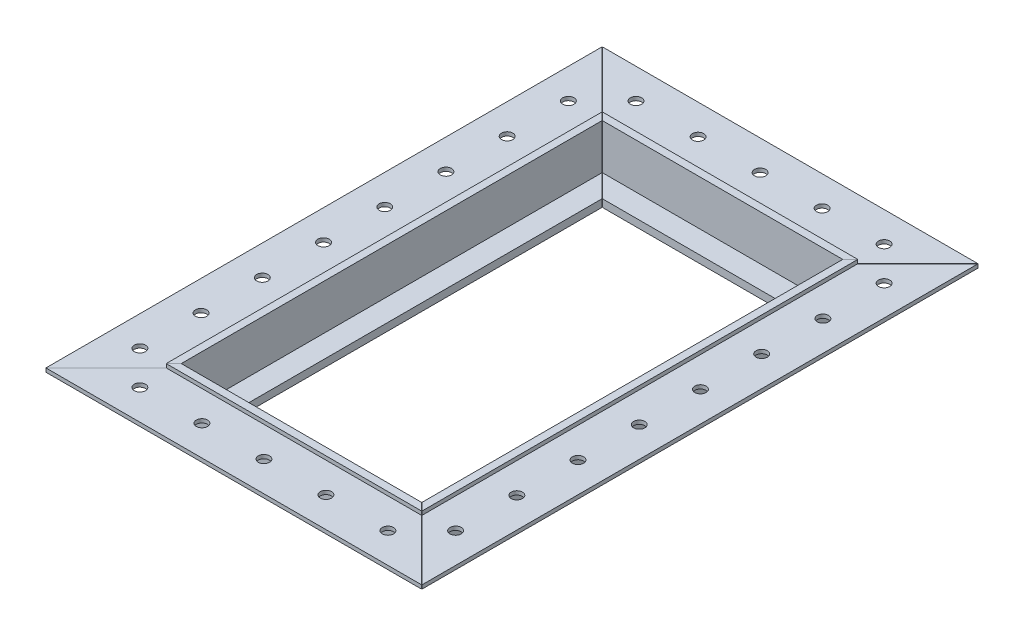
from build123d import *

# Parameters (mm, degrees)
BOSS_EXTRUDE1_DEPTH    = 88.9
BOSS_EXTRUDE1_2_DEPTH  = 88.9
BOSS_EXTRUDE2_DEPTH    = 79.375
SKETCH4_W              = 25.4
SKETCH4_H              = 234.95
CUT_EXTRUDE1_DEPTH     = 158.75
SKETCH5_W              = 25.4
SKETCH5_H              = 19.05
CUT_EXTRUDE2_DEPTH     = 243.820047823
CUT_EXTRUDE3_DEPTH     = 170.855081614
SKETCH7_R              = 2.38125
CUT_EXTRUDE4_DEPTH     = 2.54
LPATTERN1_COUNT        = 8
LPATTERN1_PITCH        = 25.853571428
SKETCH8_R              = 2.3749
CUT_EXTRUDE5_DEPTH     = 2.54
LPATTERN2_COUNT        = 5
LPATTERN2_PITCH        = 26.19375
SKETCH9_R              = 2.3749
SKETCH9_R_2            = 2.38125
CUT_EXTRUDE6_DEPTH     = 2.54
SKETCH11_R             = 3.175
SKETCH11_R_2           = 1.5875
BOSS_EXTRUDE3_DEPTH    = 3.175
BOSS_EXTRUDE3_2_DEPTH  = 3.175
BOSS_EXTRUDE3_3_DEPTH  = 3.175
BOSS_EXTRUDE3_4_DEPTH  = 3.175
BOSS_EXTRUDE3_5_DEPTH  = 3.175
BOSS_EXTRUDE3_6_DEPTH  = 3.175
BOSS_EXTRUDE3_7_DEPTH  = 3.175
BOSS_EXTRUDE3_8_DEPTH  = 3.175
BOSS_EXTRUDE3_9_DEPTH  = 3.175
BOSS_EXTRUDE3_10_DEPTH = 3.175
SKETCH12_R             = 3.175
CUT_EXTRUDE10_DEPTH    = 5.08
SKETCH13_R             = 1.5875
BOSS_EXTRUDE4_DEPTH    = 3.175


with BuildPart() as part:
    # Sketch1 → Boss-Extrude1 (new, symmetric)
    with BuildSketch(Plane.XY):
        Polygon((82.55, 3.175), (82.55, 0), (95.25, 0), (95.25, 19.05), (120.65, 19.05), (120.65, 20.6375), (95.25, 20.6375), (95.25, 22.225), (92.075, 22.225), (92.075, 3.175), align=None)
    extrude(amount=BOSS_EXTRUDE1_DEPTH, both=True)



with BuildPart() as body_2:
    # Sketch1 → Boss-Extrude1 2 (new, symmetric)
    with BuildSketch(Plane.XY):
        Polygon((0, 0), (-12.7, 0), (-12.7, 19.05), (-38.1, 19.05), (-38.1, 20.6375), (-12.7, 20.6375), (-12.7, 22.225), (-9.525, 22.225), (-9.525, 3.175), (0, 3.175), align=None)
    extrude(amount=BOSS_EXTRUDE1_2_DEPTH, both=True)


with BuildPart() as part_1:
    add(part.part)

    add(body_2.part)  # Boss-Extrude2 merges body 2
    # Sketch3 → Boss-Extrude2 (add, symmetric)
    with BuildSketch(Plane.ZY.offset(-41.275)):
        Polygon((-79.375, 3.175), (-79.375, 0), (-92.075, 0), (-92.075, 19.05), (-117.475, 19.05), (-117.475, 20.6375), (-92.075, 20.6375), (-92.075, 22.225), (-88.9, 22.225), (-88.9, 3.175), align=None)
        Polygon((79.375, 3.175), (79.375, 0), (92.075, 0), (92.075, 19.05), (117.475, 19.05), (117.475, 20.6375), (92.075, 20.6375), (92.075, 22.225), (88.9, 22.225), (88.9, 3.175), align=None)
    extrude(amount=BOSS_EXTRUDE2_DEPTH, both=True)

    # Sketch4 → Cut-Extrude1 (cut)
    with BuildSketch(Plane(origin=(0, 20.6375, 0), x_dir=(1, 0, 0), z_dir=(0, 1, 0))):
        with Locations((107.95, 0)):
            Rectangle(SKETCH4_W, SKETCH4_H)
        with Locations((-25.4, 0)):
            Rectangle(SKETCH4_W, SKETCH4_H)
    extrude(amount=CUT_EXTRUDE1_DEPTH, mode=Mode.SUBTRACT)

    # Sketch5 → Cut-Extrude2 (cut, through all)
    with BuildSketch(Plane.XY.offset(92.075)):
        with Locations((-25.4, 9.525)):
            Rectangle(SKETCH5_W, SKETCH5_H)
        with Locations((107.95, 9.525)):
            Rectangle(SKETCH5_W, SKETCH5_H)
    extrude(amount=-CUT_EXTRUDE2_DEPTH, mode=Mode.SUBTRACT)

    # Sketch6 → Cut-Extrude3 (cut, through all)
    with BuildSketch(Plane(origin=(0, 22.225, 0), x_dir=(1, 0, 0), z_dir=(0, 1, 0))):
        Polygon((120.632039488, 117.492960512), (73.363990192, 70.224911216), (73.757679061, 70.546758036), (120.667960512, 117.457039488), align=None)
        Polygon((-38.082039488, 117.492960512), (-38.117960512, 117.457039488), (8.792320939, 70.546758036), (9.186009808, 70.224911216), align=None)
        Polygon((-38.082039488, -117.492960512), (9.186009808, -70.224911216), (8.792320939, -70.546758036), (-38.117960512, -117.457039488), align=None)
        Polygon((120.632039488, -117.492960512), (120.667960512, -117.457039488), (73.757679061, -70.546758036), (73.363990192, -70.224911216), align=None)
    extrude(amount=-CUT_EXTRUDE3_DEPTH, mode=Mode.SUBTRACT)


with BuildPart() as cut_extrude3_piece_1:
    # of the separate pieces the step leaves, piece 1, a body of its own (cut_extrude3_pieces)
    add(part_1.part.solids().sort_by_distance((-9.525, 3.175, -88.864078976))[0])

    # Sketch7 → Cut-Extrude4 (cut)
    with BuildSketch(Plane(origin=(0, 20.6375, 0), x_dir=(1, 0, 0), z_dir=(0, 1, 0))):
        with Locations(Location((-25.4, 90.4875, 0), (0, 0, 180))):
            Circle(SKETCH7_R)
    cut_extrude4 = extrude(amount=-CUT_EXTRUDE4_DEPTH, mode=Mode.SUBTRACT)

    # LPattern1: Cut-Extrude4 ×8
    with Locations(*[(0, 0, i * LPATTERN1_PITCH) for i in range(1, LPATTERN1_COUNT)]):
        add(cut_extrude4, mode=Mode.SUBTRACT)



with BuildPart() as cut_extrude3_piece_2:
    # of the separate pieces the step leaves, piece 2, a body of its own (cut_extrude3_pieces)
    add(part_1.part.solids().sort_by_distance((92.075, 3.175, 88.864078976))[0])


with BuildPart() as cut_extrude3_piece_3:
    # of the separate pieces the step leaves, piece 3, a body of its own (cut_extrude3_pieces)
    add(part_1.part.solids().sort_by_distance((92.039078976, 3.175, -88.9))[0])

    # Sketch8 → Cut-Extrude5 (cut)
    with BuildSketch(Plane(origin=(0, 20.6375, 0), x_dir=(1, 0, 0), z_dir=(0, 1, 0))):
        with Locations(Location((-11.1125, 104.775, 0), (0, 0, 180))):
            Circle(SKETCH8_R)
    cut_extrude5 = extrude(amount=-CUT_EXTRUDE5_DEPTH, mode=Mode.SUBTRACT)

    # LPattern2: Cut-Extrude5 ×5
    with Locations(*[(i * LPATTERN2_PITCH, 0, 0) for i in range(1, LPATTERN2_COUNT)]):
        add(cut_extrude5, mode=Mode.SUBTRACT)


with BuildPart() as cut_extrude3_piece_4:
    # of the separate pieces the step leaves, piece 4, a body of its own (cut_extrude3_pieces)
    add(part_1.part.solids().sort_by_distance((-9.489078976, 3.175, 88.9))[0])


with BuildPart() as cut_extrude6_tool:
    # Sketch9 → Cut-Extrude6 (new body)
    with BuildSketch(Plane(origin=(0, 20.6375, 0), x_dir=(1, 0, 0), z_dir=(0, 1, 0))):
        with Locations(Location((41.275, 104.775, 0), (0, 0, 180))):
            Circle(SKETCH9_R)
        with Locations(Location((15.08125, 104.775, 0), (0, 0, 180))):
            Circle(SKETCH9_R)
        with Locations(Location((-11.1125, 104.775, 0), (0, 0, 180))):
            Circle(SKETCH9_R)
        with Locations(Location((67.46875, 104.775, 0), (0, 0, 180))):
            Circle(SKETCH9_R)
        with Locations(Location((93.6625, 104.775, 0), (0, 0, 180))):
            Circle(SKETCH9_R)
        with Locations(Location((-25.4, -90.487499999, 0), (0, 0, 180))):
            Circle(SKETCH9_R_2)
        with Locations(Location((-25.4, -64.63392857, 0), (0, 0, 180))):
            Circle(SKETCH9_R_2)
        with Locations(Location((-25.4, -38.780357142, 0), (0, 0, 180))):
            Circle(SKETCH9_R_2)
        with Locations(Location((-25.4, -12.926785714, 0), (0, 0, 180))):
            Circle(SKETCH9_R_2)
        with Locations(Location((-25.4, 12.926785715, 0), (0, 0, 180))):
            Circle(SKETCH9_R_2)
        with Locations(Location((-25.4, 38.780357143, 0), (0, 0, 180))):
            Circle(SKETCH9_R_2)
        with Locations(Location((-25.4, 64.633928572, 0), (0, 0, 180))):
            Circle(SKETCH9_R_2)
        with Locations(Location((-25.4, 90.4875, 0), (0, 0, 180))):
            Circle(SKETCH9_R_2)
        with Locations(Location((93.6625, -104.775, 0), (0, 0, 180))):
            Circle(SKETCH9_R)
        with Locations(Location((67.46875, -104.775, 0), (0, 0, 180))):
            Circle(SKETCH9_R)
        with Locations(Location((-11.1125, -104.775, 0), (0, 0, 180))):
            Circle(SKETCH9_R)
        with Locations(Location((15.08125, -104.775, 0), (0, 0, 180))):
            Circle(SKETCH9_R)
        with Locations(Location((41.275, -104.775, 0), (0, 0, 180))):
            Circle(SKETCH9_R)
        with Locations(Location((107.95, 90.4875, 0), (0, 0, 180))):
            Circle(SKETCH9_R_2)
        with Locations(Location((107.95, 64.633928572, 0), (0, 0, 180))):
            Circle(SKETCH9_R_2)
        with Locations(Location((107.95, 38.780357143, 0), (0, 0, 180))):
            Circle(SKETCH9_R_2)
        with Locations(Location((107.95, 12.926785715, 0), (0, 0, 180))):
            Circle(SKETCH9_R_2)
        with Locations(Location((107.95, -12.926785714, 0), (0, 0, 180))):
            Circle(SKETCH9_R_2)
        with Locations(Location((107.95, -38.780357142, 0), (0, 0, 180))):
            Circle(SKETCH9_R_2)
        with Locations(Location((107.95, -64.63392857, 0), (0, 0, 180))):
            Circle(SKETCH9_R_2)
        with Locations(Location((107.95, -90.487499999, 0), (0, 0, 180))):
            Circle(SKETCH9_R_2)
    extrude(amount=-CUT_EXTRUDE6_DEPTH)


with BuildPart() as cut_extrude3_piece_2_1:
    add(cut_extrude3_piece_2.part)

    # Cut-Extrude6: cut by cut_extrude6_tool
    add(cut_extrude6_tool.part, mode=Mode.SUBTRACT)


with BuildPart() as cut_extrude3_piece_4_1:
    add(cut_extrude3_piece_4.part)

    # Cut-Extrude6: cut by cut_extrude6_tool
    add(cut_extrude6_tool.part, mode=Mode.SUBTRACT)


with BuildPart() as body_5:
    # Sketch11 → Boss-Extrude3 (new body)
    with BuildSketch(Plane(origin=(0, 3.175, 0), x_dir=(1, 0, 0), z_dir=(0, 1, 0))):
        with Locations(Location((3.185521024, -85.725, 0), (0, 0, 180))):
            Circle(SKETCH11_R)
        with Locations(Location((3.185521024, -85.725, 0), (0, 0, 180))):
            Circle(SKETCH11_R_2, mode=Mode.SUBTRACT)
    extrude(amount=BOSS_EXTRUDE3_DEPTH)


with BuildPart() as body_6:
    # Sketch11 → Boss-Extrude3 2 (new body)
    with BuildSketch(Plane(origin=(0, 3.175, 0), x_dir=(1, 0, 0), z_dir=(0, 1, 0))):
        with Locations(Location((-6.35, -76.2, 0), (0, 0, 180))):
            Circle(SKETCH11_R)
        with Locations(Location((-6.35, -76.2, 0), (0, 0, 180))):
            Circle(SKETCH11_R_2, mode=Mode.SUBTRACT)
    extrude(amount=BOSS_EXTRUDE3_2_DEPTH)


with BuildPart() as body_7:
    # Sketch11 → Boss-Extrude3 3 (new body)
    with BuildSketch(Plane(origin=(0, 3.175, 0), x_dir=(1, 0, 0), z_dir=(0, 1, 0))):
        with Locations(Location((-6.35, 0, 0), (0, 0, 180))):
            Circle(SKETCH11_R)
        with Locations(Location((-6.35, 0, 0), (0, 0, 180))):
            Circle(SKETCH11_R_2, mode=Mode.SUBTRACT)
    extrude(amount=BOSS_EXTRUDE3_3_DEPTH)


with BuildPart() as body_8:
    # Sketch11 → Boss-Extrude3 4 (new body)
    with BuildSketch(Plane(origin=(0, 3.175, 0), x_dir=(1, 0, 0), z_dir=(0, 1, 0))):
        with Locations(Location((-6.35, 76.2, 0), (0, 0, 180))):
            Circle(SKETCH11_R)
        with Locations(Location((-6.35, 76.2, 0), (0, 0, 180))):
            Circle(SKETCH11_R_2, mode=Mode.SUBTRACT)
    extrude(amount=BOSS_EXTRUDE3_4_DEPTH)


with BuildPart() as body_9:
    # Sketch11 → Boss-Extrude3 5 (new body)
    with BuildSketch(Plane(origin=(0, 3.175, 0), x_dir=(1, 0, 0), z_dir=(0, 1, 0))):
        with Locations(Location((3.185521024, 85.725, 0), (0, 0, 180))):
            Circle(SKETCH11_R)
        with Locations(Location((3.185521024, 85.725, 0), (0, 0, 180))):
            Circle(SKETCH11_R_2, mode=Mode.SUBTRACT)
    extrude(amount=BOSS_EXTRUDE3_5_DEPTH)


with BuildPart() as body_10:
    # Sketch11 → Boss-Extrude3 6 (new body)
    with BuildSketch(Plane(origin=(0, 3.175, 0), x_dir=(1, 0, 0), z_dir=(0, 1, 0))):
        with Locations(Location((79.364478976, 85.725, 0), (0, 0, 180))):
            Circle(SKETCH11_R)
        with Locations(Location((79.364478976, 85.725, 0), (0, 0, 180))):
            Circle(SKETCH11_R_2, mode=Mode.SUBTRACT)
    extrude(amount=BOSS_EXTRUDE3_6_DEPTH)


with BuildPart() as body_11:
    # Sketch11 → Boss-Extrude3 7 (new body)
    with BuildSketch(Plane(origin=(0, 3.175, 0), x_dir=(1, 0, 0), z_dir=(0, 1, 0))):
        with Locations(Location((88.9, 76.2, 0), (0, 0, 180))):
            Circle(SKETCH11_R)
        with Locations(Location((88.9, 76.2, 0), (0, 0, 180))):
            Circle(SKETCH11_R_2, mode=Mode.SUBTRACT)
    extrude(amount=BOSS_EXTRUDE3_7_DEPTH)


with BuildPart() as body_12:
    # Sketch11 → Boss-Extrude3 8 (new body)
    with BuildSketch(Plane(origin=(0, 3.175, 0), x_dir=(1, 0, 0), z_dir=(0, 1, 0))):
        with Locations(Location((88.9, 0, 0), (0, 0, 180))):
            Circle(SKETCH11_R)
        with Locations(Location((88.9, 0, 0), (0, 0, 180))):
            Circle(SKETCH11_R_2, mode=Mode.SUBTRACT)
    extrude(amount=BOSS_EXTRUDE3_8_DEPTH)


with BuildPart() as body_13:
    # Sketch11 → Boss-Extrude3 9 (new body)
    with BuildSketch(Plane(origin=(0, 3.175, 0), x_dir=(1, 0, 0), z_dir=(0, 1, 0))):
        with Locations(Location((88.9, -76.2, 0), (0, 0, 180))):
            Circle(SKETCH11_R)
        with Locations(Location((88.9, -76.2, 0), (0, 0, 180))):
            Circle(SKETCH11_R_2, mode=Mode.SUBTRACT)
    extrude(amount=BOSS_EXTRUDE3_9_DEPTH)


with BuildPart() as body_14:
    # Sketch11 → Boss-Extrude3 10 (new body)
    with BuildSketch(Plane(origin=(0, 3.175, 0), x_dir=(1, 0, 0), z_dir=(0, 1, 0))):
        with Locations(Location((79.364478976, -85.725, 0), (0, 0, 180))):
            Circle(SKETCH11_R)
        with Locations(Location((79.364478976, -85.725, 0), (0, 0, 180))):
            Circle(SKETCH11_R_2, mode=Mode.SUBTRACT)
    extrude(amount=BOSS_EXTRUDE3_10_DEPTH)


with BuildPart() as cut_extrude10_tool:
    # Sketch12 → Cut-Extrude10 (new body)
    with BuildSketch(Plane(origin=(0, 3.175, 0), x_dir=(1, 0, 0), z_dir=(0, 1, 0))):
        with Locations((-6.35, 76.2)):
            Circle(SKETCH12_R)
        with Locations((3.185521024, 85.725)):
            Circle(SKETCH12_R)
        with Locations((79.364478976, 85.725)):
            Circle(SKETCH12_R)
        with Locations((88.9, 76.2)):
            Circle(SKETCH12_R)
        with Locations((88.9, 0)):
            Circle(SKETCH12_R)
        with Locations((-6.35, 0)):
            Circle(SKETCH12_R)
        with Locations((-6.35, -76.2)):
            Circle(SKETCH12_R)
        with Locations((3.185521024, -85.725)):
            Circle(SKETCH12_R)
        with Locations((79.364478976, -85.725)):
            Circle(SKETCH12_R)
        with Locations((88.9, -76.2)):
            Circle(SKETCH12_R)
    extrude(amount=CUT_EXTRUDE10_DEPTH)


with BuildPart() as body_5_1:
    add(body_5.part)

    # Cut-Extrude10: cut by cut_extrude10_tool
    add(cut_extrude10_tool.part, mode=Mode.SUBTRACT)


with BuildPart() as body_6_1:
    add(body_6.part)

    # Cut-Extrude10: cut by cut_extrude10_tool
    add(cut_extrude10_tool.part, mode=Mode.SUBTRACT)


with BuildPart() as body_7_1:
    add(body_7.part)

    # Cut-Extrude10: cut by cut_extrude10_tool
    add(cut_extrude10_tool.part, mode=Mode.SUBTRACT)


with BuildPart() as body_8_1:
    add(body_8.part)

    # Cut-Extrude10: cut by cut_extrude10_tool
    add(cut_extrude10_tool.part, mode=Mode.SUBTRACT)


with BuildPart() as body_9_1:
    add(body_9.part)

    # Cut-Extrude10: cut by cut_extrude10_tool
    add(cut_extrude10_tool.part, mode=Mode.SUBTRACT)


with BuildPart() as body_10_1:
    add(body_10.part)

    # Cut-Extrude10: cut by cut_extrude10_tool
    add(cut_extrude10_tool.part, mode=Mode.SUBTRACT)


with BuildPart() as body_11_1:
    add(body_11.part)

    # Cut-Extrude10: cut by cut_extrude10_tool
    add(cut_extrude10_tool.part, mode=Mode.SUBTRACT)


with BuildPart() as body_12_1:
    add(body_12.part)

    # Cut-Extrude10: cut by cut_extrude10_tool
    add(cut_extrude10_tool.part, mode=Mode.SUBTRACT)


with BuildPart() as body_13_1:
    add(body_13.part)

    # Cut-Extrude10: cut by cut_extrude10_tool
    add(cut_extrude10_tool.part, mode=Mode.SUBTRACT)


with BuildPart() as body_14_1:
    add(body_14.part)

    # Cut-Extrude10: cut by cut_extrude10_tool
    add(cut_extrude10_tool.part, mode=Mode.SUBTRACT)


with BuildPart() as cut_extrude3_piece_1_1:
    add(cut_extrude3_piece_1.part)

    add(cut_extrude3_piece_2_1.part)  # Boss-Extrude4 merges Cut-Extrude3 piece 2

    add(cut_extrude3_piece_3.part)  # Boss-Extrude4 merges Cut-Extrude3 piece 3

    add(cut_extrude3_piece_4_1.part)  # Boss-Extrude4 merges Cut-Extrude3 piece 4
    # Sketch13 → Boss-Extrude4 (add)
    with BuildSketch(Plane(origin=(0, 3.175, 0), x_dir=(1, 0, 0), z_dir=(0, 1, 0))):
        with Locations((3.185521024, 85.725)):
            Circle(SKETCH13_R)
        with Locations((79.364478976, 85.725)):
            Circle(SKETCH13_R)
        with Locations((3.185521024, -85.725)):
            Circle(SKETCH13_R)
        with Locations((79.364478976, -85.725)):
            Circle(SKETCH13_R)
        with Locations((88.9, 0)):
            Circle(SKETCH13_R)
        with Locations((-6.35, 0)):
            Circle(SKETCH13_R)
    extrude(amount=-BOSS_EXTRUDE4_DEPTH)


solid = cut_extrude3_piece_1_1.part
